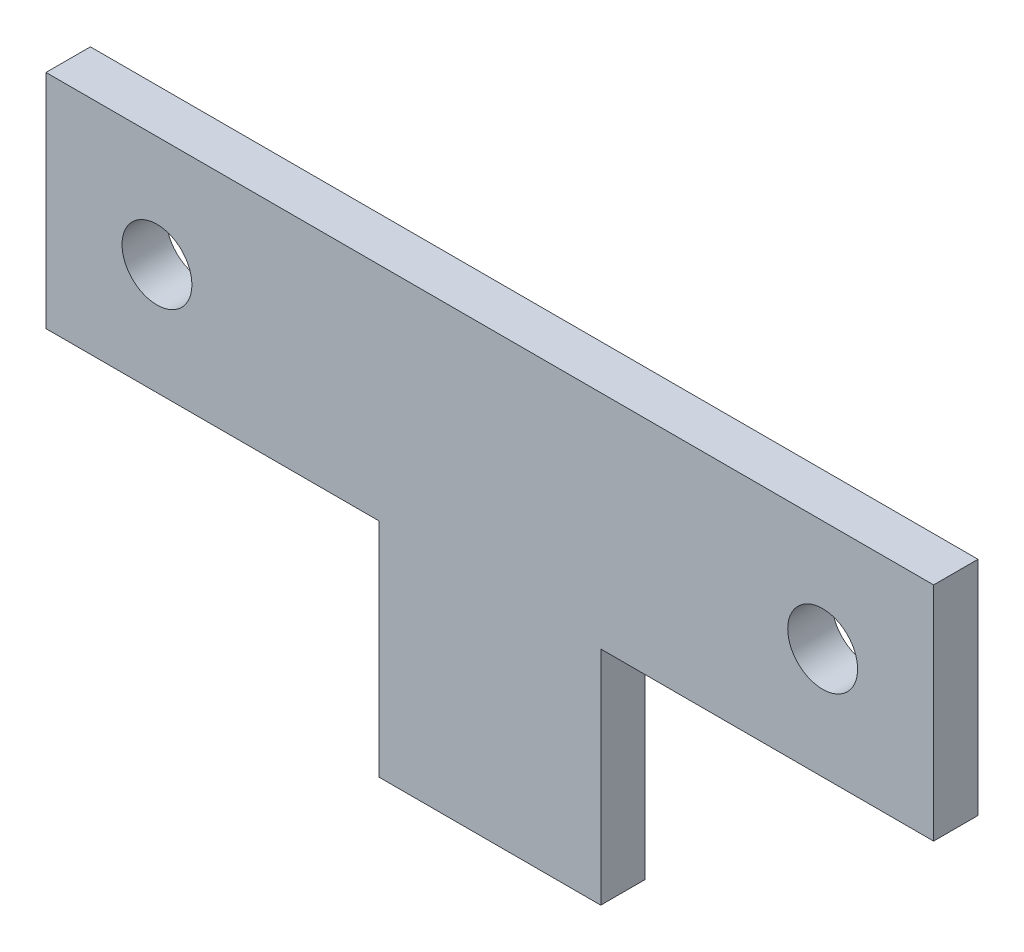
ISO-10303-21;
HEADER;
FILE_DESCRIPTION(('STEP AP214'),'2;1');
FILE_NAME('part.step','',(''),(''),'','','');
FILE_SCHEMA(('AUTOMOTIVE_DESIGN { 1 0 10303 214 1 1 1 1 }'));
ENDSEC;
DATA;
#1=APPLICATION_CONTEXT('core data for automotive mechanical design processes');
#2=APPLICATION_PROTOCOL_DEFINITION('international standard','automotive_design',2000,#1);
#3=PRODUCT_CONTEXT('',#1,'mechanical');
#4=PRODUCT('Part','Part','',(#3));
#5=PRODUCT_RELATED_PRODUCT_CATEGORY('part','',(#4));
#6=PRODUCT_DEFINITION_FORMATION('','',#4);
#7=PRODUCT_DEFINITION_CONTEXT('part definition',#1,'design');
#8=PRODUCT_DEFINITION('design','',#6,#7);
#9=PRODUCT_DEFINITION_SHAPE('','',#8);
#10=(LENGTH_UNIT() NAMED_UNIT(*) SI_UNIT(.MILLI.,.METRE.));
#11=(NAMED_UNIT(*) PLANE_ANGLE_UNIT() SI_UNIT($,.RADIAN.));
#12=(NAMED_UNIT(*) SI_UNIT($,.STERADIAN.) SOLID_ANGLE_UNIT());
#13=UNCERTAINTY_MEASURE_WITH_UNIT(LENGTH_MEASURE(1.E-05),#10,'distance_accuracy_value','');
#14=(GEOMETRIC_REPRESENTATION_CONTEXT(3) GLOBAL_UNCERTAINTY_ASSIGNED_CONTEXT((#13)) GLOBAL_UNIT_ASSIGNED_CONTEXT((#10,
#11,#12)) REPRESENTATION_CONTEXT('',''));
#15=CARTESIAN_POINT('',(0.,0.,0.));
#16=DIRECTION('',(0.,0.,1.));
#17=DIRECTION('',(1.,0.,0.));
#18=AXIS2_PLACEMENT_3D('',#15,#16,#17);
#19=CARTESIAN_POINT('',(-50.8,-12.7,5.08));
#20=DIRECTION('',(0.,1.,0.));
#21=DIRECTION('',(0.,0.,1.));
#22=AXIS2_PLACEMENT_3D('',#19,#20,#21);
#23=PLANE('',#22);
#24=DIRECTION('',(0.,0.,-1.));
#25=VECTOR('',#24,1.);
#26=CARTESIAN_POINT('',(-12.7,-12.7,5.08));
#27=LINE('',#26,#25);
#28=CARTESIAN_POINT('',(-12.7,-12.7,5.08));
#29=VERTEX_POINT('',#28);
#30=CARTESIAN_POINT('',(-12.7,-12.7,0.));
#31=VERTEX_POINT('',#30);
#32=EDGE_CURVE('E124',#29,#31,#27,.T.);
#33=ORIENTED_EDGE('',*,*,#32,.F.);
#34=DIRECTION('',(1.,0.,0.));
#35=VECTOR('',#34,1.);
#36=CARTESIAN_POINT('',(-50.8,-12.7,5.08));
#37=LINE('',#36,#35);
#38=CARTESIAN_POINT('',(-50.8,-12.7,5.08));
#39=VERTEX_POINT('',#38);
#40=EDGE_CURVE('E185',#39,#29,#37,.T.);
#41=ORIENTED_EDGE('',*,*,#40,.F.);
#42=DIRECTION('',(0.,0.,-1.));
#43=VECTOR('',#42,1.);
#44=CARTESIAN_POINT('',(-50.8,-12.7,5.08));
#45=LINE('',#44,#43);
#46=CARTESIAN_POINT('',(-50.8,-12.7,0.));
#47=VERTEX_POINT('',#46);
#48=EDGE_CURVE('E204',#39,#47,#45,.T.);
#49=ORIENTED_EDGE('',*,*,#48,.T.);
#50=DIRECTION('',(1.,0.,0.));
#51=VECTOR('',#50,1.);
#52=CARTESIAN_POINT('',(-50.8,-12.7,0.));
#53=LINE('',#52,#51);
#54=EDGE_CURVE('E179',#47,#31,#53,.T.);
#55=ORIENTED_EDGE('',*,*,#54,.T.);
#56=EDGE_LOOP('',(#33,#41,#49,#55));
#57=FACE_BOUND('',#56,.T.);
#58=ADVANCED_FACE('F43',(#57),#23,.F.);
#59=CARTESIAN_POINT('',(50.8,-12.7,5.08));
#60=DIRECTION('',(-1.,0.,0.));
#61=DIRECTION('',(0.,0.,1.));
#62=AXIS2_PLACEMENT_3D('',#59,#60,#61);
#63=PLANE('',#62);
#64=DIRECTION('',(0.,1.,0.));
#65=VECTOR('',#64,1.);
#66=CARTESIAN_POINT('',(50.8,-12.7,0.));
#67=LINE('',#66,#65);
#68=CARTESIAN_POINT('',(50.8,-12.7,0.));
#69=VERTEX_POINT('',#68);
#70=CARTESIAN_POINT('',(50.8,12.7,0.));
#71=VERTEX_POINT('',#70);
#72=EDGE_CURVE('E172',#69,#71,#67,.T.);
#73=ORIENTED_EDGE('',*,*,#72,.T.);
#74=DIRECTION('',(0.,0.,-1.));
#75=VECTOR('',#74,1.);
#76=CARTESIAN_POINT('',(50.8,12.7,5.08));
#77=LINE('',#76,#75);
#78=CARTESIAN_POINT('',(50.8,12.7,5.08));
#79=VERTEX_POINT('',#78);
#80=EDGE_CURVE('E11',#79,#71,#77,.T.);
#81=ORIENTED_EDGE('',*,*,#80,.F.);
#82=DIRECTION('',(0.,1.,0.));
#83=VECTOR('',#82,1.);
#84=CARTESIAN_POINT('',(50.8,-12.7,5.08));
#85=LINE('',#84,#83);
#86=CARTESIAN_POINT('',(50.8,-12.7,5.08));
#87=VERTEX_POINT('',#86);
#88=EDGE_CURVE('E176',#87,#79,#85,.T.);
#89=ORIENTED_EDGE('',*,*,#88,.F.);
#90=DIRECTION('',(0.,0.,-1.));
#91=VECTOR('',#90,1.);
#92=CARTESIAN_POINT('',(50.8,-12.7,5.08));
#93=LINE('',#92,#91);
#94=EDGE_CURVE('E189',#87,#69,#93,.T.);
#95=ORIENTED_EDGE('',*,*,#94,.T.);
#96=EDGE_LOOP('',(#73,#81,#89,#95));
#97=FACE_BOUND('',#96,.T.);
#98=ADVANCED_FACE('F45',(#97),#63,.F.);
#99=CARTESIAN_POINT('',(-50.8,12.7,5.08));
#100=DIRECTION('',(0.,-1.,0.));
#101=DIRECTION('',(0.,0.,-1.));
#102=AXIS2_PLACEMENT_3D('',#99,#100,#101);
#103=PLANE('',#102);
#104=DIRECTION('',(-1.,0.,0.));
#105=VECTOR('',#104,1.);
#106=CARTESIAN_POINT('',(-50.8,12.7,0.));
#107=LINE('',#106,#105);
#108=CARTESIAN_POINT('',(-50.8,12.7,0.));
#109=VERTEX_POINT('',#108);
#110=EDGE_CURVE('E193',#71,#109,#107,.T.);
#111=ORIENTED_EDGE('',*,*,#110,.T.);
#112=DIRECTION('',(0.,0.,-1.));
#113=VECTOR('',#112,1.);
#114=CARTESIAN_POINT('',(-50.8,12.7,5.08));
#115=LINE('',#114,#113);
#116=CARTESIAN_POINT('',(-50.8,12.7,5.08));
#117=VERTEX_POINT('',#116);
#118=EDGE_CURVE('E52',#117,#109,#115,.T.);
#119=ORIENTED_EDGE('',*,*,#118,.F.);
#120=DIRECTION('',(-1.,0.,0.));
#121=VECTOR('',#120,1.);
#122=CARTESIAN_POINT('',(-50.8,12.7,5.08));
#123=LINE('',#122,#121);
#124=EDGE_CURVE('E94',#79,#117,#123,.T.);
#125=ORIENTED_EDGE('',*,*,#124,.F.);
#126=ORIENTED_EDGE('',*,*,#80,.T.);
#127=EDGE_LOOP('',(#111,#119,#125,#126));
#128=FACE_BOUND('',#127,.T.);
#129=ADVANCED_FACE('F224',(#128),#103,.F.);
#130=CARTESIAN_POINT('',(-50.8,-12.7,5.08));
#131=DIRECTION('',(1.,0.,0.));
#132=DIRECTION('',(0.,0.,-1.));
#133=AXIS2_PLACEMENT_3D('',#130,#131,#132);
#134=PLANE('',#133);
#135=DIRECTION('',(0.,-1.,0.));
#136=VECTOR('',#135,1.);
#137=CARTESIAN_POINT('',(-50.8,-12.7,0.));
#138=LINE('',#137,#136);
#139=EDGE_CURVE('E196',#109,#47,#138,.T.);
#140=ORIENTED_EDGE('',*,*,#139,.T.);
#141=ORIENTED_EDGE('',*,*,#48,.F.);
#142=DIRECTION('',(0.,-1.,0.));
#143=VECTOR('',#142,1.);
#144=CARTESIAN_POINT('',(-50.8,-12.7,5.08));
#145=LINE('',#144,#143);
#146=EDGE_CURVE('E182',#117,#39,#145,.T.);
#147=ORIENTED_EDGE('',*,*,#146,.F.);
#148=ORIENTED_EDGE('',*,*,#118,.T.);
#149=EDGE_LOOP('',(#140,#141,#147,#148));
#150=FACE_BOUND('',#149,.T.);
#151=ADVANCED_FACE('F212',(#150),#134,.F.);
#152=CARTESIAN_POINT('',(12.7,-12.7,5.08));
#153=VERTEX_POINT('',#152);
#154=EDGE_CURVE('E65',#153,#87,#37,.T.);
#155=ORIENTED_EDGE('',*,*,#154,.F.);
#156=DIRECTION('',(0.,0.,-1.));
#157=VECTOR('',#156,1.);
#158=CARTESIAN_POINT('',(12.7,-12.7,5.08));
#159=LINE('',#158,#157);
#160=CARTESIAN_POINT('',(12.7,-12.7,0.));
#161=VERTEX_POINT('',#160);
#162=EDGE_CURVE('E156',#153,#161,#159,.T.);
#163=ORIENTED_EDGE('',*,*,#162,.T.);
#164=EDGE_CURVE('E87',#161,#69,#53,.T.);
#165=ORIENTED_EDGE('',*,*,#164,.T.);
#166=ORIENTED_EDGE('',*,*,#94,.F.);
#167=EDGE_LOOP('',(#155,#163,#165,#166));
#168=FACE_BOUND('',#167,.T.);
#169=ADVANCED_FACE('F230',(#168),#23,.F.);
#170=CARTESIAN_POINT('',(0.,0.,5.08));
#171=DIRECTION('',(0.,0.,-1.));
#172=DIRECTION('',(-1.,0.,0.));
#173=AXIS2_PLACEMENT_3D('',#170,#171,#172);
#174=PLANE('',#173);
#175=CARTESIAN_POINT('',(38.1,0.,5.08));
#176=DIRECTION('',(0.,0.,-1.));
#177=DIRECTION('',(-1.,0.,0.));
#178=AXIS2_PLACEMENT_3D('',#175,#176,#177);
#179=CIRCLE('',#178,4.00000000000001);
#180=CARTESIAN_POINT('',(34.1,0.,5.08));
#181=VERTEX_POINT('',#180);
#182=EDGE_CURVE('E159',#181,#181,#179,.T.);
#183=ORIENTED_EDGE('',*,*,#182,.T.);
#184=EDGE_LOOP('',(#183));
#185=FACE_BOUND('',#184,.T.);
#186=ORIENTED_EDGE('',*,*,#124,.T.);
#187=ORIENTED_EDGE('',*,*,#146,.T.);
#188=ORIENTED_EDGE('',*,*,#40,.T.);
#189=DIRECTION('',(0.,1.,0.));
#190=VECTOR('',#189,1.);
#191=CARTESIAN_POINT('',(-12.7,-38.1,5.08));
#192=LINE('',#191,#190);
#193=CARTESIAN_POINT('',(-12.7,-38.1,5.08));
#194=VERTEX_POINT('',#193);
#195=EDGE_CURVE('E135',#194,#29,#192,.T.);
#196=ORIENTED_EDGE('',*,*,#195,.F.);
#197=DIRECTION('',(1.,0.,0.));
#198=VECTOR('',#197,1.);
#199=CARTESIAN_POINT('',(-12.7,-38.1,5.08));
#200=LINE('',#199,#198);
#201=CARTESIAN_POINT('',(12.7,-38.1,5.08));
#202=VERTEX_POINT('',#201);
#203=EDGE_CURVE('E147',#194,#202,#200,.T.);
#204=ORIENTED_EDGE('',*,*,#203,.T.);
#205=DIRECTION('',(0.,1.,0.));
#206=VECTOR('',#205,1.);
#207=CARTESIAN_POINT('',(12.7,-38.1,5.08));
#208=LINE('',#207,#206);
#209=EDGE_CURVE('E59',#202,#153,#208,.T.);
#210=ORIENTED_EDGE('',*,*,#209,.T.);
#211=ORIENTED_EDGE('',*,*,#154,.T.);
#212=ORIENTED_EDGE('',*,*,#88,.T.);
#213=EDGE_LOOP('',(#186,#187,#188,#196,#204,#210,#211,#212));
#214=FACE_BOUND('',#213,.T.);
#215=CARTESIAN_POINT('',(-38.1,0.,5.08));
#216=DIRECTION('',(0.,0.,1.));
#217=DIRECTION('',(1.,0.,0.));
#218=AXIS2_PLACEMENT_3D('',#215,#216,#217);
#219=CIRCLE('',#218,4.00000000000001);
#220=CARTESIAN_POINT('',(-34.1,0.,5.08));
#221=VERTEX_POINT('',#220);
#222=EDGE_CURVE('E164',#221,#221,#219,.T.);
#223=ORIENTED_EDGE('',*,*,#222,.F.);
#224=EDGE_LOOP('',(#223));
#225=FACE_BOUND('',#224,.T.);
#226=ADVANCED_FACE('F219',(#185,#214,#225),#174,.F.);
#227=CARTESIAN_POINT('',(0.,0.,0.));
#228=DIRECTION('',(0.,0.,-1.));
#229=DIRECTION('',(-1.,0.,0.));
#230=AXIS2_PLACEMENT_3D('',#227,#228,#229);
#231=PLANE('',#230);
#232=ORIENTED_EDGE('',*,*,#164,.F.);
#233=DIRECTION('',(0.,1.,0.));
#234=VECTOR('',#233,1.);
#235=CARTESIAN_POINT('',(12.7,-38.1,0.));
#236=LINE('',#235,#234);
#237=CARTESIAN_POINT('',(12.7,-38.1,0.));
#238=VERTEX_POINT('',#237);
#239=EDGE_CURVE('E119',#238,#161,#236,.T.);
#240=ORIENTED_EDGE('',*,*,#239,.F.);
#241=DIRECTION('',(1.,0.,0.));
#242=VECTOR('',#241,1.);
#243=CARTESIAN_POINT('',(-12.7,-38.1,0.));
#244=LINE('',#243,#242);
#245=CARTESIAN_POINT('',(-12.7,-38.1,0.));
#246=VERTEX_POINT('',#245);
#247=EDGE_CURVE('E132',#246,#238,#244,.T.);
#248=ORIENTED_EDGE('',*,*,#247,.F.);
#249=DIRECTION('',(0.,1.,0.));
#250=VECTOR('',#249,1.);
#251=CARTESIAN_POINT('',(-12.7,-38.1,0.));
#252=LINE('',#251,#250);
#253=EDGE_CURVE('E140',#246,#31,#252,.T.);
#254=ORIENTED_EDGE('',*,*,#253,.T.);
#255=ORIENTED_EDGE('',*,*,#54,.F.);
#256=ORIENTED_EDGE('',*,*,#139,.F.);
#257=ORIENTED_EDGE('',*,*,#110,.F.);
#258=ORIENTED_EDGE('',*,*,#72,.F.);
#259=EDGE_LOOP('',(#232,#240,#248,#254,#255,#256,#257,#258));
#260=FACE_BOUND('',#259,.T.);
#261=CARTESIAN_POINT('',(38.1,0.,0.));
#262=DIRECTION('',(0.,0.,-1.));
#263=DIRECTION('',(-1.,0.,0.));
#264=AXIS2_PLACEMENT_3D('',#261,#262,#263);
#265=CIRCLE('',#264,4.00000000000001);
#266=CARTESIAN_POINT('',(34.1,0.,0.));
#267=VERTEX_POINT('',#266);
#268=EDGE_CURVE('E160',#267,#267,#265,.T.);
#269=ORIENTED_EDGE('',*,*,#268,.F.);
#270=EDGE_LOOP('',(#269));
#271=FACE_BOUND('',#270,.T.);
#272=CARTESIAN_POINT('',(-38.1,0.,0.));
#273=DIRECTION('',(0.,0.,1.));
#274=DIRECTION('',(1.,0.,0.));
#275=AXIS2_PLACEMENT_3D('',#272,#273,#274);
#276=CIRCLE('',#275,4.00000000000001);
#277=CARTESIAN_POINT('',(-34.1,0.,0.));
#278=VERTEX_POINT('',#277);
#279=EDGE_CURVE('E168',#278,#278,#276,.T.);
#280=ORIENTED_EDGE('',*,*,#279,.T.);
#281=EDGE_LOOP('',(#280));
#282=FACE_BOUND('',#281,.T.);
#283=ADVANCED_FACE('F129',(#260,#271,#282),#231,.T.);
#284=CARTESIAN_POINT('',(-38.1,0.,0.));
#285=DIRECTION('',(0.,0.,1.));
#286=DIRECTION('',(1.,0.,0.));
#287=AXIS2_PLACEMENT_3D('',#284,#285,#286);
#288=CYLINDRICAL_SURFACE('',#287,4.00000000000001);
#289=ORIENTED_EDGE('',*,*,#279,.F.);
#290=EDGE_LOOP('',(#289));
#291=FACE_BOUND('',#290,.T.);
#292=ORIENTED_EDGE('',*,*,#222,.T.);
#293=EDGE_LOOP('',(#292));
#294=FACE_BOUND('',#293,.T.);
#295=ADVANCED_FACE('F248',(#291,#294),#288,.F.);
#296=CARTESIAN_POINT('',(38.1,0.,0.));
#297=DIRECTION('',(0.,0.,1.));
#298=DIRECTION('',(1.,0.,0.));
#299=AXIS2_PLACEMENT_3D('',#296,#297,#298);
#300=CYLINDRICAL_SURFACE('',#299,4.00000000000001);
#301=ORIENTED_EDGE('',*,*,#268,.T.);
#302=EDGE_LOOP('',(#301));
#303=FACE_BOUND('',#302,.T.);
#304=ORIENTED_EDGE('',*,*,#182,.F.);
#305=EDGE_LOOP('',(#304));
#306=FACE_BOUND('',#305,.T.);
#307=ADVANCED_FACE('F252',(#303,#306),#300,.F.);
#308=CARTESIAN_POINT('',(12.7,-38.1,0.));
#309=DIRECTION('',(1.,0.,0.));
#310=DIRECTION('',(0.,1.,0.));
#311=AXIS2_PLACEMENT_3D('',#308,#309,#310);
#312=PLANE('',#311);
#313=ORIENTED_EDGE('',*,*,#162,.F.);
#314=ORIENTED_EDGE('',*,*,#209,.F.);
#315=DIRECTION('',(0.,0.,1.));
#316=VECTOR('',#315,1.);
#317=CARTESIAN_POINT('',(12.7,-38.1,0.));
#318=LINE('',#317,#316);
#319=EDGE_CURVE('E116',#238,#202,#318,.T.);
#320=ORIENTED_EDGE('',*,*,#319,.F.);
#321=ORIENTED_EDGE('',*,*,#239,.T.);
#322=EDGE_LOOP('',(#313,#314,#320,#321));
#323=FACE_BOUND('',#322,.T.);
#324=ADVANCED_FACE('F118',(#323),#312,.T.);
#325=CARTESIAN_POINT('',(-12.7,-38.1,0.));
#326=DIRECTION('',(1.,0.,0.));
#327=DIRECTION('',(0.,0.,-1.));
#328=AXIS2_PLACEMENT_3D('',#325,#326,#327);
#329=PLANE('',#328);
#330=ORIENTED_EDGE('',*,*,#195,.T.);
#331=ORIENTED_EDGE('',*,*,#32,.T.);
#332=ORIENTED_EDGE('',*,*,#253,.F.);
#333=DIRECTION('',(0.,0.,1.));
#334=VECTOR('',#333,1.);
#335=CARTESIAN_POINT('',(-12.7,-38.1,0.));
#336=LINE('',#335,#334);
#337=EDGE_CURVE('E125',#246,#194,#336,.T.);
#338=ORIENTED_EDGE('',*,*,#337,.T.);
#339=EDGE_LOOP('',(#330,#331,#332,#338));
#340=FACE_BOUND('',#339,.T.);
#341=ADVANCED_FACE('F259',(#340),#329,.F.);
#342=CARTESIAN_POINT('',(-12.7,-38.1,0.));
#343=DIRECTION('',(0.,-1.,0.));
#344=DIRECTION('',(0.,0.,-1.));
#345=AXIS2_PLACEMENT_3D('',#342,#343,#344);
#346=PLANE('',#345);
#347=ORIENTED_EDGE('',*,*,#203,.F.);
#348=ORIENTED_EDGE('',*,*,#337,.F.);
#349=ORIENTED_EDGE('',*,*,#247,.T.);
#350=ORIENTED_EDGE('',*,*,#319,.T.);
#351=EDGE_LOOP('',(#347,#348,#349,#350));
#352=FACE_BOUND('',#351,.T.);
#353=ADVANCED_FACE('F137',(#352),#346,.T.);
#354=CLOSED_SHELL('',(#58,#98,#129,#151,#169,#226,#283,#295,#307,#324,#341,#353));
#355=MANIFOLD_SOLID_BREP('B2',#354);
#356=ADVANCED_BREP_SHAPE_REPRESENTATION('',(#18,#355),#14);
#357=SHAPE_DEFINITION_REPRESENTATION(#9,#356);
ENDSEC;
END-ISO-10303-21;
